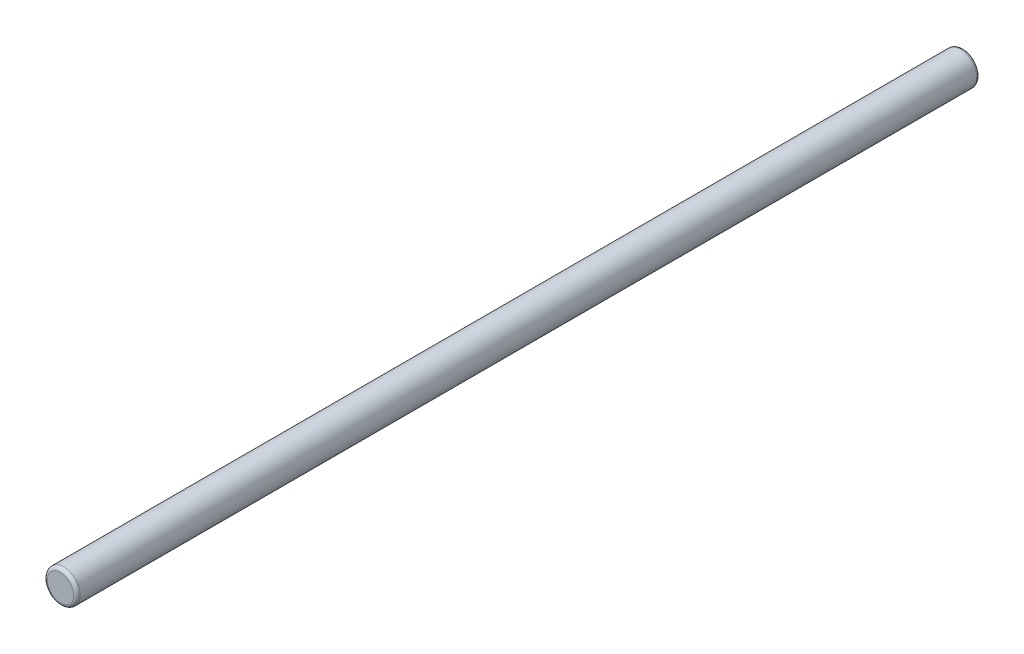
from build123d import *

# Parameters (mm, degrees)
SKETCH1_R           = 5
BOSS_EXTRUDE1_DEPTH = 137.5
FILLET1_R           = 1


with BuildPart() as part:
    # Sketch1 → Boss-Extrude1 (new, symmetric)
    with BuildSketch(Plane.XY):
        Circle(SKETCH1_R)
    extrude(amount=BOSS_EXTRUDE1_DEPTH, both=True)

    # Fillet1
    fillet1_edges = [part.edges().sort_by_distance(p)[0] for p in [
        (-5, 0, -137.5),
        (-5, 0, 137.5),
    ]]
    fillet(fillet1_edges, radius=FILLET1_R)


solid = part.part
